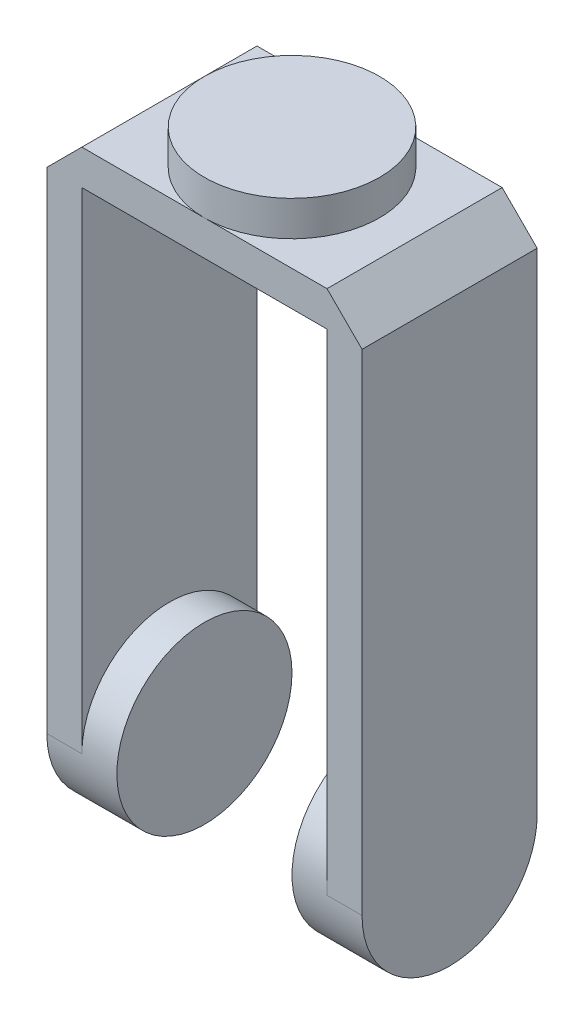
from build123d import *
from build123d.topology import SkipClean

# Parameters (mm, degrees)
EXTRUDE_5_DEPTH      = 25
EXTRUDE_5_DEPTH_BACK = 25
SKETCH_1_W           = 50
SKETCH_1_H           = 10
SKETCH_1_W_2         = 10
SKETCH_1_H_2         = 165
CUT_EXTRUDE_3_DEPTH  = 10
CUT_EXTRUDE_4_DEPTH  = 107
SKETCH_8_R           = 25
EXTRUDE_6_DEPTH      = 10
EXTRUDE_START        = 10
SKETCH_9_R           = 25
EXTRUDE_7_DEPTH      = 10


with BuildPart() as part:
    # Sketch 1 → Extrude 5 (new, two sides: drawn at the far end of the back side and taken through both)
    with BuildSketch(Plane.XY.offset(-EXTRUDE_5_DEPTH_BACK)):
        Polygon((-35, -10), (-45, -20), (-35, -20), (35, -20), (45, -20), (35, -10), (25, -10), (-25, -10), align=None)
        with Locations((0, -5)):
            Rectangle(SKETCH_1_W, SKETCH_1_H)
        with Locations((-40, -102.5)):
            Rectangle(SKETCH_1_W_2, SKETCH_1_H_2)
        with Locations((40, -102.5)):
            Rectangle(SKETCH_1_W_2, SKETCH_1_H_2)
    extrude(amount=EXTRUDE_5_DEPTH + EXTRUDE_5_DEPTH_BACK)

    # Sketch 6 → Cut-Extrude 3 (cut)
    with BuildSketch(Plane(origin=(0, 0, 0), x_dir=(1, 0, 0), z_dir=(0, 1, 0))):
        with BuildLine():
            Line((2.6e-08, 25), (-25, 25))
            Line((-25, 25), (-25, 2.6e-08))
            ThreePointArc((-25, 2.6e-08), (-17.677669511, 17.677669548), (2.6e-08, 25))
        make_face()
        with BuildLine():
            Line((25, 25), (2.6e-08, 25))
            ThreePointArc((2.6e-08, 25), (17.677669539, 17.67766952), (25, 0))
            Line((25, 0), (25, 25))
        make_face()
        with BuildLine():
            Line((25, -25), (25, 0))
            ThreePointArc((25, 0), (17.677669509, -17.67766955), (-5.8e-08, -25))
            Line((-5.8e-08, -25), (25, -25))
        make_face()
        with BuildLine():
            ThreePointArc((-5.8e-08, -25), (-17.677669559, -17.6776695), (-25, 2.6e-08))
            Line((-25, 2.6e-08), (-25, -25))
            Line((-25, -25), (-5.8e-08, -25))
        make_face()
    extrude(amount=-CUT_EXTRUDE_3_DEPTH, mode=Mode.SUBTRACT)

    # Sketch 7 → Cut-Extrude 4 (cut)
    with BuildSketch(Plane.ZY.offset(45)):
        with BuildLine():
            ThreePointArc((-5.8e-08, -185), (-17.67766955, -177.677669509), (-25, -160))
            Line((-25, -160), (-25, -185))
            Line((-25, -185), (-5.8e-08, -185))
        make_face()
        with BuildLine():
            Line((25, -185), (25, -160))
            ThreePointArc((25, -160), (17.677669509, -177.67766955), (-5.8e-08, -185))
            Line((-5.8e-08, -185), (25, -185))
        make_face()
    extrude(amount=-CUT_EXTRUDE_4_DEPTH, mode=Mode.SUBTRACT)

    # Sketch 8 → Extrude 6 (add)
    with BuildSketch(Plane(origin=(-35, 0, 0), x_dir=(0, 0, -1), z_dir=(1, 0, 0))):
        with Locations((0, -160)):
            Circle(SKETCH_8_R)
    extrude(amount=EXTRUDE_6_DEPTH)

    # Sketch 9 → Extrude 7 (add)
    with SkipClean():  # the faces are left unmerged after this step: merging them gives an invalid solid
        with BuildSketch(Plane.ZY.offset(-35).offset(EXTRUDE_START)):
            with Locations(Location((0, -160, 0), (0, 0, 270))):
                Circle(SKETCH_9_R)
        extrude(amount=-EXTRUDE_7_DEPTH)


solid = part.part
